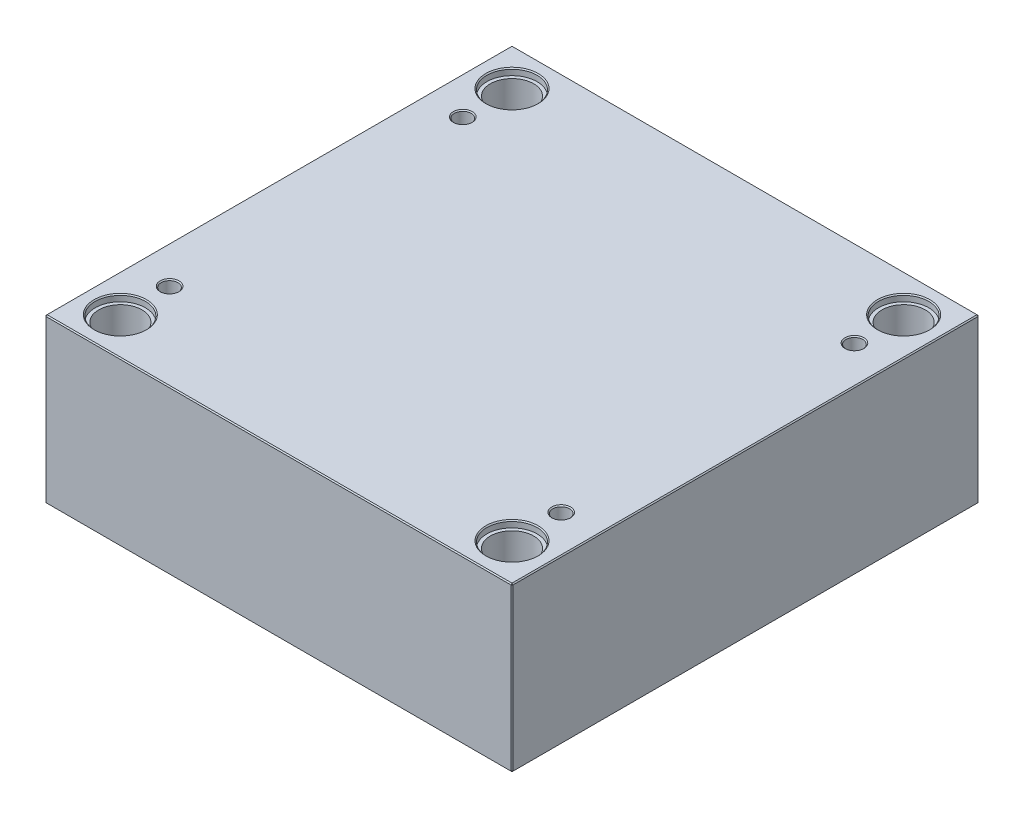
ISO-10303-21;
HEADER;
FILE_DESCRIPTION(('STEP AP214'),'2;1');
FILE_NAME('part.step','',(''),(''),'','','');
FILE_SCHEMA(('AUTOMOTIVE_DESIGN { 1 0 10303 214 1 1 1 1 }'));
ENDSEC;
DATA;
#1=APPLICATION_CONTEXT('core data for automotive mechanical design processes');
#2=APPLICATION_PROTOCOL_DEFINITION('international standard','automotive_design',2000,#1);
#3=PRODUCT_CONTEXT('',#1,'mechanical');
#4=PRODUCT('Part','Part','',(#3));
#5=PRODUCT_RELATED_PRODUCT_CATEGORY('part','',(#4));
#6=PRODUCT_DEFINITION_FORMATION('','',#4);
#7=PRODUCT_DEFINITION_CONTEXT('part definition',#1,'design');
#8=PRODUCT_DEFINITION('design','',#6,#7);
#9=PRODUCT_DEFINITION_SHAPE('','',#8);
#10=(LENGTH_UNIT() NAMED_UNIT(*) SI_UNIT(.MILLI.,.METRE.));
#11=(NAMED_UNIT(*) PLANE_ANGLE_UNIT() SI_UNIT($,.RADIAN.));
#12=(NAMED_UNIT(*) SI_UNIT($,.STERADIAN.) SOLID_ANGLE_UNIT());
#13=UNCERTAINTY_MEASURE_WITH_UNIT(LENGTH_MEASURE(1.E-05),#10,'distance_accuracy_value','');
#14=(GEOMETRIC_REPRESENTATION_CONTEXT(3) GLOBAL_UNCERTAINTY_ASSIGNED_CONTEXT((#13)) GLOBAL_UNIT_ASSIGNED_CONTEXT((#10,
#11,#12)) REPRESENTATION_CONTEXT('',''));
#15=CARTESIAN_POINT('',(0.,0.,0.));
#16=DIRECTION('',(0.,0.,1.));
#17=DIRECTION('',(1.,0.,0.));
#18=AXIS2_PLACEMENT_3D('',#15,#16,#17);
#19=CARTESIAN_POINT('',(-187.,0.,-187.));
#20=DIRECTION('',(0.,1.,0.));
#21=DIRECTION('',(0.,0.,1.));
#22=AXIS2_PLACEMENT_3D('',#19,#20,#21);
#23=CYLINDRICAL_SURFACE('',#22,20.65);
#24=CARTESIAN_POINT('',(-187.,0.999999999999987,-187.));
#25=DIRECTION('',(0.,1.,0.));
#26=DIRECTION('',(0.,0.,1.));
#27=AXIS2_PLACEMENT_3D('',#24,#25,#26);
#28=CIRCLE('',#27,20.65);
#29=CARTESIAN_POINT('',(-187.,0.999999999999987,-166.35));
#30=VERTEX_POINT('',#29);
#31=EDGE_CURVE('E472',#30,#30,#28,.F.);
#32=ORIENTED_EDGE('',*,*,#31,.T.);
#33=EDGE_LOOP('',(#32));
#34=FACE_BOUND('',#33,.T.);
#35=CARTESIAN_POINT('',(-187.,149.7,-187.));
#36=DIRECTION('',(0.,1.,0.));
#37=DIRECTION('',(0.,0.,1.));
#38=AXIS2_PLACEMENT_3D('',#35,#36,#37);
#39=CIRCLE('',#38,20.65);
#40=CARTESIAN_POINT('',(-187.,149.7,-166.35));
#41=VERTEX_POINT('',#40);
#42=EDGE_CURVE('E221',#41,#41,#39,.F.);
#43=ORIENTED_EDGE('',*,*,#42,.F.);
#44=EDGE_LOOP('',(#43));
#45=FACE_BOUND('',#44,.T.);
#46=ADVANCED_FACE('F16',(#34,#45),#23,.F.);
#47=CARTESIAN_POINT('',(187.,0.,-187.));
#48=DIRECTION('',(0.,1.,0.));
#49=DIRECTION('',(0.,0.,1.));
#50=AXIS2_PLACEMENT_3D('',#47,#48,#49);
#51=CYLINDRICAL_SURFACE('',#50,20.65);
#52=CARTESIAN_POINT('',(187.,0.999999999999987,-187.));
#53=DIRECTION('',(0.,1.,0.));
#54=DIRECTION('',(0.,0.,1.));
#55=AXIS2_PLACEMENT_3D('',#52,#53,#54);
#56=CIRCLE('',#55,20.65);
#57=CARTESIAN_POINT('',(187.,0.999999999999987,-166.35));
#58=VERTEX_POINT('',#57);
#59=EDGE_CURVE('E474',#58,#58,#56,.F.);
#60=ORIENTED_EDGE('',*,*,#59,.T.);
#61=EDGE_LOOP('',(#60));
#62=FACE_BOUND('',#61,.T.);
#63=CARTESIAN_POINT('',(187.,149.7,-187.));
#64=DIRECTION('',(0.,1.,0.));
#65=DIRECTION('',(0.,0.,1.));
#66=AXIS2_PLACEMENT_3D('',#63,#64,#65);
#67=CIRCLE('',#66,20.65);
#68=CARTESIAN_POINT('',(187.,149.7,-166.35));
#69=VERTEX_POINT('',#68);
#70=EDGE_CURVE('E218',#69,#69,#67,.F.);
#71=ORIENTED_EDGE('',*,*,#70,.F.);
#72=EDGE_LOOP('',(#71));
#73=FACE_BOUND('',#72,.T.);
#74=ADVANCED_FACE('F263',(#62,#73),#51,.F.);
#75=CARTESIAN_POINT('',(187.,0.,187.));
#76=DIRECTION('',(0.,1.,0.));
#77=DIRECTION('',(0.,0.,1.));
#78=AXIS2_PLACEMENT_3D('',#75,#76,#77);
#79=CYLINDRICAL_SURFACE('',#78,20.65);
#80=CARTESIAN_POINT('',(187.,0.999999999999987,187.));
#81=DIRECTION('',(0.,1.,0.));
#82=DIRECTION('',(0.,0.,1.));
#83=AXIS2_PLACEMENT_3D('',#80,#81,#82);
#84=CIRCLE('',#83,20.65);
#85=CARTESIAN_POINT('',(187.,0.999999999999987,207.65));
#86=VERTEX_POINT('',#85);
#87=EDGE_CURVE('E477',#86,#86,#84,.F.);
#88=ORIENTED_EDGE('',*,*,#87,.T.);
#89=EDGE_LOOP('',(#88));
#90=FACE_BOUND('',#89,.T.);
#91=CARTESIAN_POINT('',(187.,149.7,187.));
#92=DIRECTION('',(0.,1.,0.));
#93=DIRECTION('',(0.,0.,1.));
#94=AXIS2_PLACEMENT_3D('',#91,#92,#93);
#95=CIRCLE('',#94,20.65);
#96=CARTESIAN_POINT('',(187.,149.7,207.65));
#97=VERTEX_POINT('',#96);
#98=EDGE_CURVE('E214',#97,#97,#95,.F.);
#99=ORIENTED_EDGE('',*,*,#98,.F.);
#100=EDGE_LOOP('',(#99));
#101=FACE_BOUND('',#100,.T.);
#102=ADVANCED_FACE('F270',(#90,#101),#79,.F.);
#103=CARTESIAN_POINT('',(-187.,0.,187.));
#104=DIRECTION('',(0.,1.,0.));
#105=DIRECTION('',(0.,0.,1.));
#106=AXIS2_PLACEMENT_3D('',#103,#104,#105);
#107=CYLINDRICAL_SURFACE('',#106,20.65);
#108=CARTESIAN_POINT('',(-187.,0.999999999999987,187.));
#109=DIRECTION('',(0.,1.,0.));
#110=DIRECTION('',(0.,0.,1.));
#111=AXIS2_PLACEMENT_3D('',#108,#109,#110);
#112=CIRCLE('',#111,20.65);
#113=CARTESIAN_POINT('',(-187.,0.999999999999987,207.65));
#114=VERTEX_POINT('',#113);
#115=EDGE_CURVE('E480',#114,#114,#112,.F.);
#116=ORIENTED_EDGE('',*,*,#115,.T.);
#117=EDGE_LOOP('',(#116));
#118=FACE_BOUND('',#117,.T.);
#119=CARTESIAN_POINT('',(-187.,149.7,187.));
#120=DIRECTION('',(0.,1.,0.));
#121=DIRECTION('',(0.,0.,1.));
#122=AXIS2_PLACEMENT_3D('',#119,#120,#121);
#123=CIRCLE('',#122,20.65);
#124=CARTESIAN_POINT('',(-187.,149.7,207.65));
#125=VERTEX_POINT('',#124);
#126=EDGE_CURVE('E211',#125,#125,#123,.F.);
#127=ORIENTED_EDGE('',*,*,#126,.F.);
#128=EDGE_LOOP('',(#127));
#129=FACE_BOUND('',#128,.T.);
#130=ADVANCED_FACE('F277',(#118,#129),#107,.F.);
#131=CARTESIAN_POINT('',(-223.,156.,223.));
#132=DIRECTION('',(1.,0.,0.));
#133=DIRECTION('',(0.,0.,-1.));
#134=AXIS2_PLACEMENT_3D('',#131,#132,#133);
#135=PLANE('',#134);
#136=DIRECTION('',(0.,-1.,0.));
#137=VECTOR('',#136,1.);
#138=CARTESIAN_POINT('',(-223.,156.,-222.));
#139=LINE('',#138,#137);
#140=CARTESIAN_POINT('',(-223.,155.,-222.));
#141=VERTEX_POINT('',#140);
#142=CARTESIAN_POINT('',(-223.,1.00000000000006,-222.));
#143=VERTEX_POINT('',#142);
#144=EDGE_CURVE('E487',#141,#143,#139,.T.);
#145=ORIENTED_EDGE('',*,*,#144,.T.);
#146=DIRECTION('',(0.,0.,1.));
#147=VECTOR('',#146,1.);
#148=CARTESIAN_POINT('',(-223.,1.00000000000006,223.));
#149=LINE('',#148,#147);
#150=CARTESIAN_POINT('',(-223.,1.00000000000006,222.));
#151=VERTEX_POINT('',#150);
#152=EDGE_CURVE('E490',#143,#151,#149,.T.);
#153=ORIENTED_EDGE('',*,*,#152,.T.);
#154=DIRECTION('',(0.,1.,0.));
#155=VECTOR('',#154,1.);
#156=CARTESIAN_POINT('',(-223.,156.,222.));
#157=LINE('',#156,#155);
#158=CARTESIAN_POINT('',(-223.,155.,222.));
#159=VERTEX_POINT('',#158);
#160=EDGE_CURVE('E485',#151,#159,#157,.T.);
#161=ORIENTED_EDGE('',*,*,#160,.T.);
#162=DIRECTION('',(0.,0.,-1.));
#163=VECTOR('',#162,1.);
#164=CARTESIAN_POINT('',(-223.,155.,-223.));
#165=LINE('',#164,#163);
#166=EDGE_CURVE('E483',#159,#141,#165,.T.);
#167=ORIENTED_EDGE('',*,*,#166,.T.);
#168=EDGE_LOOP('',(#145,#153,#161,#167));
#169=FACE_BOUND('',#168,.T.);
#170=ADVANCED_FACE('F298',(#169),#135,.F.);
#171=CARTESIAN_POINT('',(223.,156.,223.));
#172=DIRECTION('',(0.,0.,-1.));
#173=DIRECTION('',(-1.,0.,0.));
#174=AXIS2_PLACEMENT_3D('',#171,#172,#173);
#175=PLANE('',#174);
#176=DIRECTION('',(-1.,0.,0.));
#177=VECTOR('',#176,1.);
#178=CARTESIAN_POINT('',(-223.,155.,223.));
#179=LINE('',#178,#177);
#180=CARTESIAN_POINT('',(222.,155.,223.));
#181=VERTEX_POINT('',#180);
#182=CARTESIAN_POINT('',(-222.,155.,223.));
#183=VERTEX_POINT('',#182);
#184=EDGE_CURVE('E509',#181,#183,#179,.T.);
#185=ORIENTED_EDGE('',*,*,#184,.T.);
#186=DIRECTION('',(0.,-1.,0.));
#187=VECTOR('',#186,1.);
#188=CARTESIAN_POINT('',(-222.,156.,223.));
#189=LINE('',#188,#187);
#190=CARTESIAN_POINT('',(-222.,1.,223.));
#191=VERTEX_POINT('',#190);
#192=EDGE_CURVE('E515',#183,#191,#189,.T.);
#193=ORIENTED_EDGE('',*,*,#192,.T.);
#194=DIRECTION('',(1.,0.,0.));
#195=VECTOR('',#194,1.);
#196=CARTESIAN_POINT('',(223.,1.,223.));
#197=LINE('',#196,#195);
#198=CARTESIAN_POINT('',(222.,1.,223.));
#199=VERTEX_POINT('',#198);
#200=EDGE_CURVE('E513',#191,#199,#197,.T.);
#201=ORIENTED_EDGE('',*,*,#200,.T.);
#202=DIRECTION('',(0.,1.,0.));
#203=VECTOR('',#202,1.);
#204=CARTESIAN_POINT('',(222.,156.,223.));
#205=LINE('',#204,#203);
#206=EDGE_CURVE('E511',#199,#181,#205,.T.);
#207=ORIENTED_EDGE('',*,*,#206,.T.);
#208=EDGE_LOOP('',(#185,#193,#201,#207));
#209=FACE_BOUND('',#208,.T.);
#210=ADVANCED_FACE('F294',(#209),#175,.F.);
#211=CARTESIAN_POINT('',(223.,156.,223.));
#212=DIRECTION('',(-1.,0.,0.));
#213=DIRECTION('',(0.,0.,1.));
#214=AXIS2_PLACEMENT_3D('',#211,#212,#213);
#215=PLANE('',#214);
#216=DIRECTION('',(0.,0.,-1.));
#217=VECTOR('',#216,1.);
#218=CARTESIAN_POINT('',(223.,1.,223.));
#219=LINE('',#218,#217);
#220=CARTESIAN_POINT('',(223.,1.,222.));
#221=VERTEX_POINT('',#220);
#222=CARTESIAN_POINT('',(223.,1.,-222.));
#223=VERTEX_POINT('',#222);
#224=EDGE_CURVE('E504',#221,#223,#219,.T.);
#225=ORIENTED_EDGE('',*,*,#224,.T.);
#226=DIRECTION('',(0.,1.,0.));
#227=VECTOR('',#226,1.);
#228=CARTESIAN_POINT('',(223.,156.,-222.));
#229=LINE('',#228,#227);
#230=CARTESIAN_POINT('',(223.,155.,-222.));
#231=VERTEX_POINT('',#230);
#232=EDGE_CURVE('E506',#223,#231,#229,.T.);
#233=ORIENTED_EDGE('',*,*,#232,.T.);
#234=DIRECTION('',(0.,0.,1.));
#235=VECTOR('',#234,1.);
#236=CARTESIAN_POINT('',(223.,155.,223.));
#237=LINE('',#236,#235);
#238=CARTESIAN_POINT('',(223.,155.,222.));
#239=VERTEX_POINT('',#238);
#240=EDGE_CURVE('E500',#231,#239,#237,.T.);
#241=ORIENTED_EDGE('',*,*,#240,.T.);
#242=DIRECTION('',(0.,-1.,0.));
#243=VECTOR('',#242,1.);
#244=CARTESIAN_POINT('',(223.,156.,222.));
#245=LINE('',#244,#243);
#246=EDGE_CURVE('E502',#239,#221,#245,.T.);
#247=ORIENTED_EDGE('',*,*,#246,.T.);
#248=EDGE_LOOP('',(#225,#233,#241,#247));
#249=FACE_BOUND('',#248,.T.);
#250=ADVANCED_FACE('F290',(#249),#215,.F.);
#251=CARTESIAN_POINT('',(223.,156.,-223.));
#252=DIRECTION('',(0.,0.,1.));
#253=DIRECTION('',(1.,0.,0.));
#254=AXIS2_PLACEMENT_3D('',#251,#252,#253);
#255=PLANE('',#254);
#256=DIRECTION('',(0.,-1.,0.));
#257=VECTOR('',#256,1.);
#258=CARTESIAN_POINT('',(222.,156.,-223.));
#259=LINE('',#258,#257);
#260=CARTESIAN_POINT('',(222.,155.,-223.));
#261=VERTEX_POINT('',#260);
#262=CARTESIAN_POINT('',(222.,1.,-223.));
#263=VERTEX_POINT('',#262);
#264=EDGE_CURVE('E494',#261,#263,#259,.T.);
#265=ORIENTED_EDGE('',*,*,#264,.T.);
#266=DIRECTION('',(-1.,0.,0.));
#267=VECTOR('',#266,1.);
#268=CARTESIAN_POINT('',(223.,1.,-223.));
#269=LINE('',#268,#267);
#270=CARTESIAN_POINT('',(-222.,1.,-223.));
#271=VERTEX_POINT('',#270);
#272=EDGE_CURVE('E138',#263,#271,#269,.T.);
#273=ORIENTED_EDGE('',*,*,#272,.T.);
#274=DIRECTION('',(0.,1.,0.));
#275=VECTOR('',#274,1.);
#276=CARTESIAN_POINT('',(-222.,156.,-223.));
#277=LINE('',#276,#275);
#278=CARTESIAN_POINT('',(-222.,155.,-223.));
#279=VERTEX_POINT('',#278);
#280=EDGE_CURVE('E496',#271,#279,#277,.T.);
#281=ORIENTED_EDGE('',*,*,#280,.T.);
#282=DIRECTION('',(1.,0.,0.));
#283=VECTOR('',#282,1.);
#284=CARTESIAN_POINT('',(223.,155.,-223.));
#285=LINE('',#284,#283);
#286=EDGE_CURVE('E492',#279,#261,#285,.T.);
#287=ORIENTED_EDGE('',*,*,#286,.T.);
#288=EDGE_LOOP('',(#265,#273,#281,#287));
#289=FACE_BOUND('',#288,.T.);
#290=ADVANCED_FACE('F282',(#289),#255,.F.);
#291=CARTESIAN_POINT('',(0.,156.,0.));
#292=DIRECTION('',(0.,1.,0.));
#293=DIRECTION('',(0.,0.,1.));
#294=AXIS2_PLACEMENT_3D('',#291,#292,#293);
#295=PLANE('',#294);
#296=CARTESIAN_POINT('',(187.,156.,187.));
#297=DIRECTION('',(0.,1.,0.));
#298=DIRECTION('',(0.,0.,1.));
#299=AXIS2_PLACEMENT_3D('',#296,#297,#298);
#300=CIRCLE('',#299,25.);
#301=CARTESIAN_POINT('',(187.,156.,212.));
#302=VERTEX_POINT('',#301);
#303=EDGE_CURVE('E236',#302,#302,#300,.F.);
#304=ORIENTED_EDGE('',*,*,#303,.T.);
#305=EDGE_LOOP('',(#304));
#306=FACE_BOUND('',#305,.T.);
#307=CARTESIAN_POINT('',(-187.,156.,187.));
#308=DIRECTION('',(0.,1.,0.));
#309=DIRECTION('',(0.,0.,1.));
#310=AXIS2_PLACEMENT_3D('',#307,#308,#309);
#311=CIRCLE('',#310,25.);
#312=CARTESIAN_POINT('',(-187.,156.,212.));
#313=VERTEX_POINT('',#312);
#314=EDGE_CURVE('E233',#313,#313,#311,.F.);
#315=ORIENTED_EDGE('',*,*,#314,.T.);
#316=EDGE_LOOP('',(#315));
#317=FACE_BOUND('',#316,.T.);
#318=CARTESIAN_POINT('',(187.,156.,-187.));
#319=DIRECTION('',(0.,1.,0.));
#320=DIRECTION('',(0.,0.,1.));
#321=AXIS2_PLACEMENT_3D('',#318,#319,#320);
#322=CIRCLE('',#321,25.);
#323=CARTESIAN_POINT('',(187.,156.,-162.));
#324=VERTEX_POINT('',#323);
#325=EDGE_CURVE('E230',#324,#324,#322,.F.);
#326=ORIENTED_EDGE('',*,*,#325,.T.);
#327=EDGE_LOOP('',(#326));
#328=FACE_BOUND('',#327,.T.);
#329=CARTESIAN_POINT('',(-187.,156.,-187.));
#330=DIRECTION('',(0.,1.,0.));
#331=DIRECTION('',(0.,0.,1.));
#332=AXIS2_PLACEMENT_3D('',#329,#330,#331);
#333=CIRCLE('',#332,25.);
#334=CARTESIAN_POINT('',(-187.,156.,-162.));
#335=VERTEX_POINT('',#334);
#336=EDGE_CURVE('E227',#335,#335,#333,.F.);
#337=ORIENTED_EDGE('',*,*,#336,.T.);
#338=EDGE_LOOP('',(#337));
#339=FACE_BOUND('',#338,.T.);
#340=CARTESIAN_POINT('',(-187.,156.,140.));
#341=DIRECTION('',(0.,1.,0.));
#342=DIRECTION('',(0.,0.,1.));
#343=AXIS2_PLACEMENT_3D('',#340,#341,#342);
#344=CIRCLE('',#343,9.);
#345=CARTESIAN_POINT('',(-187.,156.,149.));
#346=VERTEX_POINT('',#345);
#347=EDGE_CURVE('E198',#346,#346,#344,.F.);
#348=ORIENTED_EDGE('',*,*,#347,.T.);
#349=EDGE_LOOP('',(#348));
#350=FACE_BOUND('',#349,.T.);
#351=CARTESIAN_POINT('',(187.,156.,140.));
#352=DIRECTION('',(0.,1.,0.));
#353=DIRECTION('',(0.,0.,1.));
#354=AXIS2_PLACEMENT_3D('',#351,#352,#353);
#355=CIRCLE('',#354,9.);
#356=CARTESIAN_POINT('',(187.,156.,149.));
#357=VERTEX_POINT('',#356);
#358=EDGE_CURVE('E195',#357,#357,#355,.F.);
#359=ORIENTED_EDGE('',*,*,#358,.T.);
#360=EDGE_LOOP('',(#359));
#361=FACE_BOUND('',#360,.T.);
#362=CARTESIAN_POINT('',(187.,156.,-140.));
#363=DIRECTION('',(0.,1.,0.));
#364=DIRECTION('',(0.,0.,1.));
#365=AXIS2_PLACEMENT_3D('',#362,#363,#364);
#366=CIRCLE('',#365,9.);
#367=CARTESIAN_POINT('',(187.,156.,-131.));
#368=VERTEX_POINT('',#367);
#369=EDGE_CURVE('E192',#368,#368,#366,.F.);
#370=ORIENTED_EDGE('',*,*,#369,.T.);
#371=EDGE_LOOP('',(#370));
#372=FACE_BOUND('',#371,.T.);
#373=CARTESIAN_POINT('',(-187.,156.,-140.));
#374=DIRECTION('',(0.,1.,0.));
#375=DIRECTION('',(0.,0.,1.));
#376=AXIS2_PLACEMENT_3D('',#373,#374,#375);
#377=CIRCLE('',#376,9.);
#378=CARTESIAN_POINT('',(-187.,156.,-131.));
#379=VERTEX_POINT('',#378);
#380=EDGE_CURVE('E188',#379,#379,#377,.F.);
#381=ORIENTED_EDGE('',*,*,#380,.T.);
#382=EDGE_LOOP('',(#381));
#383=FACE_BOUND('',#382,.T.);
#384=DIRECTION('',(0.,0.,-1.));
#385=VECTOR('',#384,1.);
#386=CARTESIAN_POINT('',(222.,156.,-223.));
#387=LINE('',#386,#385);
#388=CARTESIAN_POINT('',(222.,156.,222.));
#389=VERTEX_POINT('',#388);
#390=CARTESIAN_POINT('',(222.,156.,-222.));
#391=VERTEX_POINT('',#390);
#392=EDGE_CURVE('E31',#389,#391,#387,.T.);
#393=ORIENTED_EDGE('',*,*,#392,.T.);
#394=DIRECTION('',(-1.,0.,0.));
#395=VECTOR('',#394,1.);
#396=CARTESIAN_POINT('',(-223.,156.,-222.));
#397=LINE('',#396,#395);
#398=CARTESIAN_POINT('',(-222.,156.,-222.));
#399=VERTEX_POINT('',#398);
#400=EDGE_CURVE('E189',#391,#399,#397,.T.);
#401=ORIENTED_EDGE('',*,*,#400,.T.);
#402=DIRECTION('',(0.,0.,1.));
#403=VECTOR('',#402,1.);
#404=CARTESIAN_POINT('',(-222.,156.,223.));
#405=LINE('',#404,#403);
#406=CARTESIAN_POINT('',(-222.,156.,222.));
#407=VERTEX_POINT('',#406);
#408=EDGE_CURVE('E518',#399,#407,#405,.T.);
#409=ORIENTED_EDGE('',*,*,#408,.T.);
#410=DIRECTION('',(1.,0.,0.));
#411=VECTOR('',#410,1.);
#412=CARTESIAN_POINT('',(223.,156.,222.));
#413=LINE('',#412,#411);
#414=EDGE_CURVE('E36',#407,#389,#413,.T.);
#415=ORIENTED_EDGE('',*,*,#414,.T.);
#416=EDGE_LOOP('',(#393,#401,#409,#415));
#417=FACE_BOUND('',#416,.T.);
#418=ADVANCED_FACE('F279',(#306,#317,#328,#339,#350,#361,#372,#383,#417),#295,.T.);
#419=CARTESIAN_POINT('',(0.,0.,0.));
#420=DIRECTION('',(0.,1.,0.));
#421=DIRECTION('',(0.,0.,1.));
#422=AXIS2_PLACEMENT_3D('',#419,#420,#421);
#423=PLANE('',#422);
#424=CARTESIAN_POINT('',(-187.,0.,-187.));
#425=DIRECTION('',(0.,1.,0.));
#426=DIRECTION('',(0.,0.,1.));
#427=AXIS2_PLACEMENT_3D('',#424,#425,#426);
#428=CIRCLE('',#427,21.65);
#429=CARTESIAN_POINT('',(-187.,0.,-165.35));
#430=VERTEX_POINT('',#429);
#431=EDGE_CURVE('E469',#430,#430,#428,.T.);
#432=ORIENTED_EDGE('',*,*,#431,.T.);
#433=EDGE_LOOP('',(#432));
#434=FACE_BOUND('',#433,.T.);
#435=CARTESIAN_POINT('',(187.,0.,-187.));
#436=DIRECTION('',(0.,1.,0.));
#437=DIRECTION('',(0.,0.,1.));
#438=AXIS2_PLACEMENT_3D('',#435,#436,#437);
#439=CIRCLE('',#438,21.65);
#440=CARTESIAN_POINT('',(187.,0.,-165.35));
#441=VERTEX_POINT('',#440);
#442=EDGE_CURVE('E466',#441,#441,#439,.T.);
#443=ORIENTED_EDGE('',*,*,#442,.T.);
#444=EDGE_LOOP('',(#443));
#445=FACE_BOUND('',#444,.T.);
#446=CARTESIAN_POINT('',(187.,0.,187.));
#447=DIRECTION('',(0.,1.,0.));
#448=DIRECTION('',(0.,0.,1.));
#449=AXIS2_PLACEMENT_3D('',#446,#447,#448);
#450=CIRCLE('',#449,21.65);
#451=CARTESIAN_POINT('',(187.,0.,208.65));
#452=VERTEX_POINT('',#451);
#453=EDGE_CURVE('E463',#452,#452,#450,.T.);
#454=ORIENTED_EDGE('',*,*,#453,.T.);
#455=EDGE_LOOP('',(#454));
#456=FACE_BOUND('',#455,.T.);
#457=CARTESIAN_POINT('',(-187.,0.,187.));
#458=DIRECTION('',(0.,1.,0.));
#459=DIRECTION('',(0.,0.,1.));
#460=AXIS2_PLACEMENT_3D('',#457,#458,#459);
#461=CIRCLE('',#460,21.65);
#462=CARTESIAN_POINT('',(-187.,0.,208.65));
#463=VERTEX_POINT('',#462);
#464=EDGE_CURVE('E460',#463,#463,#461,.T.);
#465=ORIENTED_EDGE('',*,*,#464,.T.);
#466=EDGE_LOOP('',(#465));
#467=FACE_BOUND('',#466,.T.);
#468=DIRECTION('',(0.,0.,1.));
#469=VECTOR('',#468,1.);
#470=CARTESIAN_POINT('',(222.,0.,0.));
#471=LINE('',#470,#469);
#472=CARTESIAN_POINT('',(222.,0.,-222.));
#473=VERTEX_POINT('',#472);
#474=CARTESIAN_POINT('',(222.,0.,222.));
#475=VERTEX_POINT('',#474);
#476=EDGE_CURVE('E108',#473,#475,#471,.T.);
#477=ORIENTED_EDGE('',*,*,#476,.T.);
#478=DIRECTION('',(-1.,0.,0.));
#479=VECTOR('',#478,1.);
#480=CARTESIAN_POINT('',(0.,0.,222.));
#481=LINE('',#480,#479);
#482=CARTESIAN_POINT('',(-222.,0.,222.));
#483=VERTEX_POINT('',#482);
#484=EDGE_CURVE('E458',#475,#483,#481,.T.);
#485=ORIENTED_EDGE('',*,*,#484,.T.);
#486=DIRECTION('',(0.,0.,-1.));
#487=VECTOR('',#486,1.);
#488=CARTESIAN_POINT('',(-222.,0.,0.));
#489=LINE('',#488,#487);
#490=CARTESIAN_POINT('',(-222.,0.,-222.));
#491=VERTEX_POINT('',#490);
#492=EDGE_CURVE('E110',#483,#491,#489,.T.);
#493=ORIENTED_EDGE('',*,*,#492,.T.);
#494=DIRECTION('',(1.,0.,0.));
#495=VECTOR('',#494,1.);
#496=CARTESIAN_POINT('',(0.,0.,-222.));
#497=LINE('',#496,#495);
#498=EDGE_CURVE('E104',#491,#473,#497,.T.);
#499=ORIENTED_EDGE('',*,*,#498,.T.);
#500=EDGE_LOOP('',(#477,#485,#493,#499));
#501=FACE_BOUND('',#500,.T.);
#502=ADVANCED_FACE('F106',(#434,#445,#456,#467,#501),#423,.F.);
#503=CARTESIAN_POINT('',(-187.,0.,-187.));
#504=DIRECTION('',(0.,-1.,0.));
#505=DIRECTION('',(0.,0.,-1.));
#506=AXIS2_PLACEMENT_3D('',#503,#504,#505);
#507=CONICAL_SURFACE('',#506,21.65,0.785398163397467);
#508=ORIENTED_EDGE('',*,*,#31,.F.);
#509=EDGE_LOOP('',(#508));
#510=FACE_BOUND('',#509,.T.);
#511=ORIENTED_EDGE('',*,*,#431,.F.);
#512=EDGE_LOOP('',(#511));
#513=FACE_BOUND('',#512,.T.);
#514=ADVANCED_FACE('F286',(#510,#513),#507,.F.);
#515=CARTESIAN_POINT('',(187.,0.,-187.));
#516=DIRECTION('',(0.,-1.,0.));
#517=DIRECTION('',(0.,0.,-1.));
#518=AXIS2_PLACEMENT_3D('',#515,#516,#517);
#519=CONICAL_SURFACE('',#518,21.65,0.785398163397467);
#520=ORIENTED_EDGE('',*,*,#59,.F.);
#521=EDGE_LOOP('',(#520));
#522=FACE_BOUND('',#521,.T.);
#523=ORIENTED_EDGE('',*,*,#442,.F.);
#524=EDGE_LOOP('',(#523));
#525=FACE_BOUND('',#524,.T.);
#526=ADVANCED_FACE('F305',(#522,#525),#519,.F.);
#527=CARTESIAN_POINT('',(187.,0.,187.));
#528=DIRECTION('',(0.,-1.,0.));
#529=DIRECTION('',(0.,0.,-1.));
#530=AXIS2_PLACEMENT_3D('',#527,#528,#529);
#531=CONICAL_SURFACE('',#530,21.65,0.785398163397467);
#532=ORIENTED_EDGE('',*,*,#87,.F.);
#533=EDGE_LOOP('',(#532));
#534=FACE_BOUND('',#533,.T.);
#535=ORIENTED_EDGE('',*,*,#453,.F.);
#536=EDGE_LOOP('',(#535));
#537=FACE_BOUND('',#536,.T.);
#538=ADVANCED_FACE('F309',(#534,#537),#531,.F.);
#539=CARTESIAN_POINT('',(-187.,0.,187.));
#540=DIRECTION('',(0.,-1.,0.));
#541=DIRECTION('',(0.,0.,-1.));
#542=AXIS2_PLACEMENT_3D('',#539,#540,#541);
#543=CONICAL_SURFACE('',#542,21.65,0.785398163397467);
#544=ORIENTED_EDGE('',*,*,#115,.F.);
#545=EDGE_LOOP('',(#544));
#546=FACE_BOUND('',#545,.T.);
#547=ORIENTED_EDGE('',*,*,#464,.F.);
#548=EDGE_LOOP('',(#547));
#549=FACE_BOUND('',#548,.T.);
#550=ADVANCED_FACE('F313',(#546,#549),#543,.F.);
#551=CARTESIAN_POINT('',(223.,156.,222.));
#552=DIRECTION('',(-0.707106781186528,0.,-0.707106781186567));
#553=DIRECTION('',(0.,-1.,0.));
#554=AXIS2_PLACEMENT_3D('',#551,#552,#553);
#555=PLANE('',#554);
#556=DIRECTION('',(-0.707106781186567,0.,0.707106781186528));
#557=VECTOR('',#556,1.);
#558=CARTESIAN_POINT('',(222.,155.,223.));
#559=LINE('',#558,#557);
#560=EDGE_CURVE('E126',#181,#239,#559,.F.);
#561=ORIENTED_EDGE('',*,*,#560,.F.);
#562=ORIENTED_EDGE('',*,*,#206,.F.);
#563=DIRECTION('',(0.707106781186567,0.,-0.707106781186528));
#564=VECTOR('',#563,1.);
#565=CARTESIAN_POINT('',(222.,1.,223.));
#566=LINE('',#565,#564);
#567=EDGE_CURVE('E180',#221,#199,#566,.F.);
#568=ORIENTED_EDGE('',*,*,#567,.F.);
#569=ORIENTED_EDGE('',*,*,#246,.F.);
#570=EDGE_LOOP('',(#561,#562,#568,#569));
#571=FACE_BOUND('',#570,.T.);
#572=ADVANCED_FACE('F317',(#571),#555,.F.);
#573=CARTESIAN_POINT('',(222.,155.,223.));
#574=DIRECTION('',(0.577350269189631,0.577350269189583,0.577350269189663));
#575=DIRECTION('',(0.707106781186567,0.,-0.707106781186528));
#576=AXIS2_PLACEMENT_3D('',#573,#574,#575);
#577=PLANE('',#576);
#578=DIRECTION('',(0.,-0.707106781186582,0.707106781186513));
#579=VECTOR('',#578,1.);
#580=CARTESIAN_POINT('',(222.,155.,223.));
#581=LINE('',#580,#579);
#582=EDGE_CURVE('E175',#181,#389,#581,.F.);
#583=ORIENTED_EDGE('',*,*,#582,.F.);
#584=ORIENTED_EDGE('',*,*,#560,.T.);
#585=DIRECTION('',(-0.707106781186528,0.707106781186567,0.));
#586=VECTOR('',#585,1.);
#587=CARTESIAN_POINT('',(222.5,155.5,222.));
#588=LINE('',#587,#586);
#589=EDGE_CURVE('E177',#389,#239,#588,.F.);
#590=ORIENTED_EDGE('',*,*,#589,.F.);
#591=EDGE_LOOP('',(#583,#584,#590));
#592=FACE_BOUND('',#591,.T.);
#593=ADVANCED_FACE('F385',(#592),#577,.T.);
#594=CARTESIAN_POINT('',(222.,1.,223.));
#595=DIRECTION('',(0.577350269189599,-0.577350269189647,0.577350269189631));
#596=DIRECTION('',(0.,-0.707106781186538,-0.707106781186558));
#597=AXIS2_PLACEMENT_3D('',#594,#595,#596);
#598=PLANE('',#597);
#599=DIRECTION('',(-0.707106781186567,-0.707106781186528,0.));
#600=VECTOR('',#599,1.);
#601=CARTESIAN_POINT('',(222.5,0.499999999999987,222.));
#602=LINE('',#601,#600);
#603=EDGE_CURVE('E124',#221,#475,#602,.T.);
#604=ORIENTED_EDGE('',*,*,#603,.F.);
#605=ORIENTED_EDGE('',*,*,#567,.T.);
#606=DIRECTION('',(0.,0.707106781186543,0.707106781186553));
#607=VECTOR('',#606,1.);
#608=CARTESIAN_POINT('',(222.,1.,223.));
#609=LINE('',#608,#607);
#610=EDGE_CURVE('E172',#475,#199,#609,.T.);
#611=ORIENTED_EDGE('',*,*,#610,.F.);
#612=EDGE_LOOP('',(#604,#605,#611));
#613=FACE_BOUND('',#612,.T.);
#614=ADVANCED_FACE('F381',(#613),#598,.T.);
#615=CARTESIAN_POINT('',(222.,156.,0.));
#616=DIRECTION('',(0.707106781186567,0.707106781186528,0.));
#617=DIRECTION('',(0.,0.,1.));
#618=AXIS2_PLACEMENT_3D('',#615,#616,#617);
#619=PLANE('',#618);
#620=ORIENTED_EDGE('',*,*,#589,.T.);
#621=ORIENTED_EDGE('',*,*,#240,.F.);
#622=DIRECTION('',(0.707106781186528,-0.707106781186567,0.));
#623=VECTOR('',#622,1.);
#624=CARTESIAN_POINT('',(223.,155.,-222.));
#625=LINE('',#624,#623);
#626=EDGE_CURVE('E166',#391,#231,#625,.T.);
#627=ORIENTED_EDGE('',*,*,#626,.F.);
#628=ORIENTED_EDGE('',*,*,#392,.F.);
#629=EDGE_LOOP('',(#620,#621,#627,#628));
#630=FACE_BOUND('',#629,.T.);
#631=ADVANCED_FACE('F377',(#630),#619,.T.);
#632=CARTESIAN_POINT('',(0.,156.,222.));
#633=DIRECTION('',(0.,0.707106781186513,0.707106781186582));
#634=DIRECTION('',(-1.,0.,0.));
#635=AXIS2_PLACEMENT_3D('',#632,#633,#634);
#636=PLANE('',#635);
#637=ORIENTED_EDGE('',*,*,#582,.T.);
#638=ORIENTED_EDGE('',*,*,#414,.F.);
#639=DIRECTION('',(0.,0.707106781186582,-0.707106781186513));
#640=VECTOR('',#639,1.);
#641=CARTESIAN_POINT('',(-222.,155.5,222.5));
#642=LINE('',#641,#640);
#643=EDGE_CURVE('E163',#183,#407,#642,.T.);
#644=ORIENTED_EDGE('',*,*,#643,.F.);
#645=ORIENTED_EDGE('',*,*,#184,.F.);
#646=EDGE_LOOP('',(#637,#638,#644,#645));
#647=FACE_BOUND('',#646,.T.);
#648=ADVANCED_FACE('F373',(#647),#636,.T.);
#649=CARTESIAN_POINT('',(-222.,156.,223.));
#650=DIRECTION('',(0.707106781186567,0.,-0.707106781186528));
#651=DIRECTION('',(0.,-1.,0.));
#652=AXIS2_PLACEMENT_3D('',#649,#650,#651);
#653=PLANE('',#652);
#654=DIRECTION('',(0.707106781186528,0.,0.707106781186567));
#655=VECTOR('',#654,1.);
#656=CARTESIAN_POINT('',(-222.,1.,223.));
#657=LINE('',#656,#655);
#658=EDGE_CURVE('E157',#191,#151,#657,.F.);
#659=ORIENTED_EDGE('',*,*,#658,.F.);
#660=ORIENTED_EDGE('',*,*,#192,.F.);
#661=DIRECTION('',(-0.707106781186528,0.,-0.707106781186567));
#662=VECTOR('',#661,1.);
#663=CARTESIAN_POINT('',(-223.,155.,222.));
#664=LINE('',#663,#662);
#665=EDGE_CURVE('E160',#159,#183,#664,.F.);
#666=ORIENTED_EDGE('',*,*,#665,.F.);
#667=ORIENTED_EDGE('',*,*,#160,.F.);
#668=EDGE_LOOP('',(#659,#660,#666,#667));
#669=FACE_BOUND('',#668,.T.);
#670=ADVANCED_FACE('F369',(#669),#653,.F.);
#671=CARTESIAN_POINT('',(223.,1.,223.));
#672=DIRECTION('',(0.,0.707106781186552,-0.707106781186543));
#673=DIRECTION('',(1.,0.,0.));
#674=AXIS2_PLACEMENT_3D('',#671,#672,#673);
#675=PLANE('',#674);
#676=ORIENTED_EDGE('',*,*,#610,.T.);
#677=ORIENTED_EDGE('',*,*,#200,.F.);
#678=DIRECTION('',(0.,-0.707106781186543,-0.707106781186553));
#679=VECTOR('',#678,1.);
#680=CARTESIAN_POINT('',(-222.,1.,223.));
#681=LINE('',#680,#679);
#682=EDGE_CURVE('E135',#483,#191,#681,.F.);
#683=ORIENTED_EDGE('',*,*,#682,.F.);
#684=ORIENTED_EDGE('',*,*,#484,.F.);
#685=EDGE_LOOP('',(#676,#677,#683,#684));
#686=FACE_BOUND('',#685,.T.);
#687=ADVANCED_FACE('F366',(#686),#675,.F.);
#688=CARTESIAN_POINT('',(223.,1.,223.));
#689=DIRECTION('',(-0.707106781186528,0.707106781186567,0.));
#690=DIRECTION('',(0.,0.,-1.));
#691=AXIS2_PLACEMENT_3D('',#688,#689,#690);
#692=PLANE('',#691);
#693=ORIENTED_EDGE('',*,*,#603,.T.);
#694=ORIENTED_EDGE('',*,*,#476,.F.);
#695=DIRECTION('',(0.707106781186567,0.707106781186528,0.));
#696=VECTOR('',#695,1.);
#697=CARTESIAN_POINT('',(222.5,0.500000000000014,-222.));
#698=LINE('',#697,#696);
#699=EDGE_CURVE('E121',#223,#473,#698,.F.);
#700=ORIENTED_EDGE('',*,*,#699,.F.);
#701=ORIENTED_EDGE('',*,*,#224,.F.);
#702=EDGE_LOOP('',(#693,#694,#700,#701));
#703=FACE_BOUND('',#702,.T.);
#704=ADVANCED_FACE('F119',(#703),#692,.F.);
#705=CARTESIAN_POINT('',(222.,156.,-223.));
#706=DIRECTION('',(-0.707106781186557,0.,0.707106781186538));
#707=DIRECTION('',(0.,-1.,0.));
#708=AXIS2_PLACEMENT_3D('',#705,#706,#707);
#709=PLANE('',#708);
#710=DIRECTION('',(0.707106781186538,0.,0.707106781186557));
#711=VECTOR('',#710,1.);
#712=CARTESIAN_POINT('',(223.,155.,-222.));
#713=LINE('',#712,#711);
#714=EDGE_CURVE('E168',#231,#261,#713,.F.);
#715=ORIENTED_EDGE('',*,*,#714,.F.);
#716=ORIENTED_EDGE('',*,*,#232,.F.);
#717=DIRECTION('',(-0.707106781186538,0.,-0.707106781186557));
#718=VECTOR('',#717,1.);
#719=CARTESIAN_POINT('',(222.,1.,-223.));
#720=LINE('',#719,#718);
#721=EDGE_CURVE('E134',#263,#223,#720,.F.);
#722=ORIENTED_EDGE('',*,*,#721,.F.);
#723=ORIENTED_EDGE('',*,*,#264,.F.);
#724=EDGE_LOOP('',(#715,#716,#722,#723));
#725=FACE_BOUND('',#724,.T.);
#726=ADVANCED_FACE('F359',(#725),#709,.F.);
#727=CARTESIAN_POINT('',(223.,155.,-222.));
#728=DIRECTION('',(0.577350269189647,0.577350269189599,-0.577350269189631));
#729=DIRECTION('',(-0.707106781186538,0.,-0.707106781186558));
#730=AXIS2_PLACEMENT_3D('',#727,#728,#729);
#731=PLANE('',#730);
#732=ORIENTED_EDGE('',*,*,#626,.T.);
#733=ORIENTED_EDGE('',*,*,#714,.T.);
#734=DIRECTION('',(0.,0.707106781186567,0.707106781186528));
#735=VECTOR('',#734,1.);
#736=CARTESIAN_POINT('',(222.,155.5,-222.5));
#737=LINE('',#736,#735);
#738=EDGE_CURVE('E152',#391,#261,#737,.F.);
#739=ORIENTED_EDGE('',*,*,#738,.F.);
#740=EDGE_LOOP('',(#732,#733,#739));
#741=FACE_BOUND('',#740,.T.);
#742=ADVANCED_FACE('F355',(#741),#731,.T.);
#743=CARTESIAN_POINT('',(-223.,155.,222.));
#744=DIRECTION('',(-0.577350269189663,0.577350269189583,0.577350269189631));
#745=DIRECTION('',(0.707106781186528,0.,0.707106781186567));
#746=AXIS2_PLACEMENT_3D('',#743,#744,#745);
#747=PLANE('',#746);
#748=ORIENTED_EDGE('',*,*,#665,.T.);
#749=ORIENTED_EDGE('',*,*,#643,.T.);
#750=DIRECTION('',(-0.707106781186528,-0.707106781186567,0.));
#751=VECTOR('',#750,1.);
#752=CARTESIAN_POINT('',(-223.,155.,222.));
#753=LINE('',#752,#751);
#754=EDGE_CURVE('E143',#159,#407,#753,.F.);
#755=ORIENTED_EDGE('',*,*,#754,.F.);
#756=EDGE_LOOP('',(#748,#749,#755));
#757=FACE_BOUND('',#756,.T.);
#758=ADVANCED_FACE('F351',(#757),#747,.T.);
#759=CARTESIAN_POINT('',(-222.,1.,223.));
#760=DIRECTION('',(-0.577350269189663,-0.577350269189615,0.577350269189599));
#761=DIRECTION('',(0.707106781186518,-0.707106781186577,0.));
#762=AXIS2_PLACEMENT_3D('',#759,#760,#761);
#763=PLANE('',#762);
#764=ORIENTED_EDGE('',*,*,#682,.T.);
#765=ORIENTED_EDGE('',*,*,#658,.T.);
#766=DIRECTION('',(-0.707106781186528,0.707106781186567,0.));
#767=VECTOR('',#766,1.);
#768=CARTESIAN_POINT('',(-222.5,0.500000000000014,222.));
#769=LINE('',#768,#767);
#770=EDGE_CURVE('E139',#483,#151,#769,.T.);
#771=ORIENTED_EDGE('',*,*,#770,.F.);
#772=EDGE_LOOP('',(#764,#765,#771));
#773=FACE_BOUND('',#772,.T.);
#774=ADVANCED_FACE('F348',(#773),#763,.T.);
#775=CARTESIAN_POINT('',(222.,1.,-223.));
#776=DIRECTION('',(0.577350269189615,-0.577350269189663,-0.577350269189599));
#777=DIRECTION('',(0.707106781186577,0.707106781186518,0.));
#778=AXIS2_PLACEMENT_3D('',#775,#776,#777);
#779=PLANE('',#778);
#780=ORIENTED_EDGE('',*,*,#721,.T.);
#781=ORIENTED_EDGE('',*,*,#699,.T.);
#782=DIRECTION('',(0.,-0.707106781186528,0.707106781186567));
#783=VECTOR('',#782,1.);
#784=CARTESIAN_POINT('',(222.,1.,-223.));
#785=LINE('',#784,#783);
#786=EDGE_CURVE('E131',#263,#473,#785,.T.);
#787=ORIENTED_EDGE('',*,*,#786,.F.);
#788=EDGE_LOOP('',(#780,#781,#787));
#789=FACE_BOUND('',#788,.T.);
#790=ADVANCED_FACE('F130',(#789),#779,.T.);
#791=CARTESIAN_POINT('',(0.,156.,-222.));
#792=DIRECTION('',(0.,0.707106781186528,-0.707106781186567));
#793=DIRECTION('',(1.,0.,0.));
#794=AXIS2_PLACEMENT_3D('',#791,#792,#793);
#795=PLANE('',#794);
#796=ORIENTED_EDGE('',*,*,#738,.T.);
#797=ORIENTED_EDGE('',*,*,#286,.F.);
#798=DIRECTION('',(0.,-0.707106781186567,-0.707106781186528));
#799=VECTOR('',#798,1.);
#800=CARTESIAN_POINT('',(-222.,155.,-223.));
#801=LINE('',#800,#799);
#802=EDGE_CURVE('E140',#399,#279,#801,.T.);
#803=ORIENTED_EDGE('',*,*,#802,.F.);
#804=ORIENTED_EDGE('',*,*,#400,.F.);
#805=EDGE_LOOP('',(#796,#797,#803,#804));
#806=FACE_BOUND('',#805,.T.);
#807=ADVANCED_FACE('F341',(#806),#795,.T.);
#808=CARTESIAN_POINT('',(-222.,156.,0.));
#809=DIRECTION('',(-0.707106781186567,0.707106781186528,0.));
#810=DIRECTION('',(0.,0.,-1.));
#811=AXIS2_PLACEMENT_3D('',#808,#809,#810);
#812=PLANE('',#811);
#813=ORIENTED_EDGE('',*,*,#754,.T.);
#814=ORIENTED_EDGE('',*,*,#408,.F.);
#815=DIRECTION('',(0.707106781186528,0.707106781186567,0.));
#816=VECTOR('',#815,1.);
#817=CARTESIAN_POINT('',(-222.5,155.5,-222.));
#818=LINE('',#817,#816);
#819=EDGE_CURVE('E146',#141,#399,#818,.T.);
#820=ORIENTED_EDGE('',*,*,#819,.F.);
#821=ORIENTED_EDGE('',*,*,#166,.F.);
#822=EDGE_LOOP('',(#813,#814,#820,#821));
#823=FACE_BOUND('',#822,.T.);
#824=ADVANCED_FACE('F337',(#823),#812,.T.);
#825=CARTESIAN_POINT('',(-223.,1.00000000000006,223.));
#826=DIRECTION('',(0.707106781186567,0.707106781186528,0.));
#827=DIRECTION('',(0.,0.,1.));
#828=AXIS2_PLACEMENT_3D('',#825,#826,#827);
#829=PLANE('',#828);
#830=ORIENTED_EDGE('',*,*,#770,.T.);
#831=ORIENTED_EDGE('',*,*,#152,.F.);
#832=DIRECTION('',(0.707106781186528,-0.707106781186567,0.));
#833=VECTOR('',#832,1.);
#834=CARTESIAN_POINT('',(-223.,1.00000000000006,-222.));
#835=LINE('',#834,#833);
#836=EDGE_CURVE('E529',#491,#143,#835,.F.);
#837=ORIENTED_EDGE('',*,*,#836,.F.);
#838=ORIENTED_EDGE('',*,*,#492,.F.);
#839=EDGE_LOOP('',(#830,#831,#837,#838));
#840=FACE_BOUND('',#839,.T.);
#841=ADVANCED_FACE('F334',(#840),#829,.F.);
#842=CARTESIAN_POINT('',(223.,1.,-223.));
#843=DIRECTION('',(0.,0.707106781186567,0.707106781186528));
#844=DIRECTION('',(-1.,0.,0.));
#845=AXIS2_PLACEMENT_3D('',#842,#843,#844);
#846=PLANE('',#845);
#847=ORIENTED_EDGE('',*,*,#786,.T.);
#848=ORIENTED_EDGE('',*,*,#498,.F.);
#849=DIRECTION('',(0.,0.707106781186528,-0.707106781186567));
#850=VECTOR('',#849,1.);
#851=CARTESIAN_POINT('',(-222.,0.5,-222.5));
#852=LINE('',#851,#850);
#853=EDGE_CURVE('E526',#271,#491,#852,.F.);
#854=ORIENTED_EDGE('',*,*,#853,.F.);
#855=ORIENTED_EDGE('',*,*,#272,.F.);
#856=EDGE_LOOP('',(#847,#848,#854,#855));
#857=FACE_BOUND('',#856,.T.);
#858=ADVANCED_FACE('F137',(#857),#846,.F.);
#859=CARTESIAN_POINT('',(-222.,155.,-223.));
#860=DIRECTION('',(-0.577350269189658,0.577350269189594,-0.577350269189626));
#861=DIRECTION('',(-0.707106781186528,0.,0.707106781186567));
#862=AXIS2_PLACEMENT_3D('',#859,#860,#861);
#863=PLANE('',#862);
#864=ORIENTED_EDGE('',*,*,#819,.T.);
#865=ORIENTED_EDGE('',*,*,#802,.T.);
#866=DIRECTION('',(0.707106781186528,0.,-0.707106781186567));
#867=VECTOR('',#866,1.);
#868=CARTESIAN_POINT('',(-222.,155.,-223.));
#869=LINE('',#868,#867);
#870=EDGE_CURVE('E524',#141,#279,#869,.T.);
#871=ORIENTED_EDGE('',*,*,#870,.F.);
#872=EDGE_LOOP('',(#864,#865,#871));
#873=FACE_BOUND('',#872,.T.);
#874=ADVANCED_FACE('F327',(#873),#863,.T.);
#875=CARTESIAN_POINT('',(-223.,1.00000000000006,-222.));
#876=DIRECTION('',(-0.577350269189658,-0.577350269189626,-0.577350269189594));
#877=DIRECTION('',(0.707106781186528,-0.707106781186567,0.));
#878=AXIS2_PLACEMENT_3D('',#875,#876,#877);
#879=PLANE('',#878);
#880=ORIENTED_EDGE('',*,*,#853,.T.);
#881=ORIENTED_EDGE('',*,*,#836,.T.);
#882=DIRECTION('',(-0.707106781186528,0.,0.707106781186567));
#883=VECTOR('',#882,1.);
#884=CARTESIAN_POINT('',(-223.,1.00000000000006,-222.));
#885=LINE('',#884,#883);
#886=EDGE_CURVE('E455',#271,#143,#885,.T.);
#887=ORIENTED_EDGE('',*,*,#886,.F.);
#888=EDGE_LOOP('',(#880,#881,#887));
#889=FACE_BOUND('',#888,.T.);
#890=ADVANCED_FACE('F323',(#889),#879,.T.);
#891=CARTESIAN_POINT('',(-223.,156.,-222.));
#892=DIRECTION('',(0.707106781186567,0.,0.707106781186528));
#893=DIRECTION('',(0.,-1.,0.));
#894=AXIS2_PLACEMENT_3D('',#891,#892,#893);
#895=PLANE('',#894);
#896=ORIENTED_EDGE('',*,*,#870,.T.);
#897=ORIENTED_EDGE('',*,*,#280,.F.);
#898=ORIENTED_EDGE('',*,*,#886,.T.);
#899=ORIENTED_EDGE('',*,*,#144,.F.);
#900=EDGE_LOOP('',(#896,#897,#898,#899));
#901=FACE_BOUND('',#900,.T.);
#902=ADVANCED_FACE('F319',(#901),#895,.F.);
#903=CARTESIAN_POINT('',(-187.,131.,-140.));
#904=DIRECTION('',(0.,1.,0.));
#905=DIRECTION('',(0.,0.,1.));
#906=AXIS2_PLACEMENT_3D('',#903,#904,#905);
#907=CYLINDRICAL_SURFACE('',#906,8.);
#908=CARTESIAN_POINT('',(-187.,155.,-140.));
#909=DIRECTION('',(0.,1.,0.));
#910=DIRECTION('',(0.,0.,1.));
#911=AXIS2_PLACEMENT_3D('',#908,#909,#910);
#912=CIRCLE('',#911,8.);
#913=CARTESIAN_POINT('',(-187.,155.,-132.));
#914=VERTEX_POINT('',#913);
#915=EDGE_CURVE('E207',#914,#914,#912,.T.);
#916=ORIENTED_EDGE('',*,*,#915,.T.);
#917=EDGE_LOOP('',(#916));
#918=FACE_BOUND('',#917,.T.);
#919=CARTESIAN_POINT('',(-187.,131.,-140.));
#920=DIRECTION('',(0.,1.,0.));
#921=DIRECTION('',(0.,0.,1.));
#922=AXIS2_PLACEMENT_3D('',#919,#920,#921);
#923=CIRCLE('',#922,8.);
#924=CARTESIAN_POINT('',(-187.,131.,-132.));
#925=VERTEX_POINT('',#924);
#926=EDGE_CURVE('E448',#925,#925,#923,.T.);
#927=ORIENTED_EDGE('',*,*,#926,.F.);
#928=EDGE_LOOP('',(#927));
#929=FACE_BOUND('',#928,.T.);
#930=ADVANCED_FACE('F322',(#918,#929),#907,.F.);
#931=CARTESIAN_POINT('',(-187.,131.,-140.));
#932=DIRECTION('',(0.,1.,0.));
#933=DIRECTION('',(0.,0.,1.));
#934=AXIS2_PLACEMENT_3D('',#931,#932,#933);
#935=PLANE('',#934);
#936=ORIENTED_EDGE('',*,*,#926,.T.);
#937=EDGE_LOOP('',(#936));
#938=FACE_BOUND('',#937,.T.);
#939=ADVANCED_FACE('F596',(#938),#935,.T.);
#940=CARTESIAN_POINT('',(187.,131.,-140.));
#941=DIRECTION('',(0.,1.,0.));
#942=DIRECTION('',(0.,0.,1.));
#943=AXIS2_PLACEMENT_3D('',#940,#941,#942);
#944=CYLINDRICAL_SURFACE('',#943,8.);
#945=CARTESIAN_POINT('',(187.,155.,-140.));
#946=DIRECTION('',(0.,1.,0.));
#947=DIRECTION('',(0.,0.,1.));
#948=AXIS2_PLACEMENT_3D('',#945,#946,#947);
#949=CIRCLE('',#948,8.);
#950=CARTESIAN_POINT('',(187.,155.,-132.));
#951=VERTEX_POINT('',#950);
#952=EDGE_CURVE('E204',#951,#951,#949,.T.);
#953=ORIENTED_EDGE('',*,*,#952,.T.);
#954=EDGE_LOOP('',(#953));
#955=FACE_BOUND('',#954,.T.);
#956=CARTESIAN_POINT('',(187.,131.,-140.));
#957=DIRECTION('',(0.,1.,0.));
#958=DIRECTION('',(0.,0.,1.));
#959=AXIS2_PLACEMENT_3D('',#956,#957,#958);
#960=CIRCLE('',#959,8.);
#961=CARTESIAN_POINT('',(187.,131.,-132.));
#962=VERTEX_POINT('',#961);
#963=EDGE_CURVE('E445',#962,#962,#960,.T.);
#964=ORIENTED_EDGE('',*,*,#963,.F.);
#965=EDGE_LOOP('',(#964));
#966=FACE_BOUND('',#965,.T.);
#967=ADVANCED_FACE('F592',(#955,#966),#944,.F.);
#968=CARTESIAN_POINT('',(187.,131.,-140.));
#969=DIRECTION('',(0.,1.,0.));
#970=DIRECTION('',(0.,0.,1.));
#971=AXIS2_PLACEMENT_3D('',#968,#969,#970);
#972=PLANE('',#971);
#973=ORIENTED_EDGE('',*,*,#963,.T.);
#974=EDGE_LOOP('',(#973));
#975=FACE_BOUND('',#974,.T.);
#976=ADVANCED_FACE('F588',(#975),#972,.T.);
#977=CARTESIAN_POINT('',(187.,131.,140.));
#978=DIRECTION('',(0.,1.,0.));
#979=DIRECTION('',(0.,0.,1.));
#980=AXIS2_PLACEMENT_3D('',#977,#978,#979);
#981=CYLINDRICAL_SURFACE('',#980,8.);
#982=CARTESIAN_POINT('',(187.,155.,140.));
#983=DIRECTION('',(0.,1.,0.));
#984=DIRECTION('',(0.,0.,1.));
#985=AXIS2_PLACEMENT_3D('',#982,#983,#984);
#986=CIRCLE('',#985,8.);
#987=CARTESIAN_POINT('',(187.,155.,148.));
#988=VERTEX_POINT('',#987);
#989=EDGE_CURVE('E201',#988,#988,#986,.T.);
#990=ORIENTED_EDGE('',*,*,#989,.T.);
#991=EDGE_LOOP('',(#990));
#992=FACE_BOUND('',#991,.T.);
#993=CARTESIAN_POINT('',(187.,131.,140.));
#994=DIRECTION('',(0.,1.,0.));
#995=DIRECTION('',(0.,0.,1.));
#996=AXIS2_PLACEMENT_3D('',#993,#994,#995);
#997=CIRCLE('',#996,8.);
#998=CARTESIAN_POINT('',(187.,131.,148.));
#999=VERTEX_POINT('',#998);
#1000=EDGE_CURVE('E449',#999,#999,#997,.T.);
#1001=ORIENTED_EDGE('',*,*,#1000,.F.);
#1002=EDGE_LOOP('',(#1001));
#1003=FACE_BOUND('',#1002,.T.);
#1004=ADVANCED_FACE('F591',(#992,#1003),#981,.F.);
#1005=CARTESIAN_POINT('',(187.,131.,140.));
#1006=DIRECTION('',(0.,1.,0.));
#1007=DIRECTION('',(0.,0.,1.));
#1008=AXIS2_PLACEMENT_3D('',#1005,#1006,#1007);
#1009=PLANE('',#1008);
#1010=ORIENTED_EDGE('',*,*,#1000,.T.);
#1011=EDGE_LOOP('',(#1010));
#1012=FACE_BOUND('',#1011,.T.);
#1013=ADVANCED_FACE('F598',(#1012),#1009,.T.);
#1014=CARTESIAN_POINT('',(-187.,131.,140.));
#1015=DIRECTION('',(0.,1.,0.));
#1016=DIRECTION('',(0.,0.,1.));
#1017=AXIS2_PLACEMENT_3D('',#1014,#1015,#1016);
#1018=CYLINDRICAL_SURFACE('',#1017,8.);
#1019=CARTESIAN_POINT('',(-187.,155.,140.));
#1020=DIRECTION('',(0.,1.,0.));
#1021=DIRECTION('',(0.,0.,1.));
#1022=AXIS2_PLACEMENT_3D('',#1019,#1020,#1021);
#1023=CIRCLE('',#1022,8.);
#1024=CARTESIAN_POINT('',(-187.,155.,148.));
#1025=VERTEX_POINT('',#1024);
#1026=EDGE_CURVE('E185',#1025,#1025,#1023,.T.);
#1027=ORIENTED_EDGE('',*,*,#1026,.T.);
#1028=EDGE_LOOP('',(#1027));
#1029=FACE_BOUND('',#1028,.T.);
#1030=CARTESIAN_POINT('',(-187.,131.,140.));
#1031=DIRECTION('',(0.,1.,0.));
#1032=DIRECTION('',(0.,0.,1.));
#1033=AXIS2_PLACEMENT_3D('',#1030,#1031,#1032);
#1034=CIRCLE('',#1033,8.);
#1035=CARTESIAN_POINT('',(-187.,131.,148.));
#1036=VERTEX_POINT('',#1035);
#1037=EDGE_CURVE('E224',#1036,#1036,#1034,.T.);
#1038=ORIENTED_EDGE('',*,*,#1037,.F.);
#1039=EDGE_LOOP('',(#1038));
#1040=FACE_BOUND('',#1039,.T.);
#1041=ADVANCED_FACE('F601',(#1029,#1040),#1018,.F.);
#1042=CARTESIAN_POINT('',(-187.,131.,140.));
#1043=DIRECTION('',(0.,1.,0.));
#1044=DIRECTION('',(0.,0.,1.));
#1045=AXIS2_PLACEMENT_3D('',#1042,#1043,#1044);
#1046=PLANE('',#1045);
#1047=ORIENTED_EDGE('',*,*,#1037,.T.);
#1048=EDGE_LOOP('',(#1047));
#1049=FACE_BOUND('',#1048,.T.);
#1050=ADVANCED_FACE('F397',(#1049),#1046,.T.);
#1051=CARTESIAN_POINT('',(-187.,155.,140.));
#1052=DIRECTION('',(0.,1.,0.));
#1053=DIRECTION('',(0.,0.,1.));
#1054=AXIS2_PLACEMENT_3D('',#1051,#1052,#1053);
#1055=CONICAL_SURFACE('',#1054,8.,0.785398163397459);
#1056=ORIENTED_EDGE('',*,*,#347,.F.);
#1057=EDGE_LOOP('',(#1056));
#1058=FACE_BOUND('',#1057,.T.);
#1059=ORIENTED_EDGE('',*,*,#1026,.F.);
#1060=EDGE_LOOP('',(#1059));
#1061=FACE_BOUND('',#1060,.T.);
#1062=ADVANCED_FACE('F393',(#1058,#1061),#1055,.F.);
#1063=CARTESIAN_POINT('',(187.,155.,140.));
#1064=DIRECTION('',(0.,1.,0.));
#1065=DIRECTION('',(0.,0.,1.));
#1066=AXIS2_PLACEMENT_3D('',#1063,#1064,#1065);
#1067=CONICAL_SURFACE('',#1066,8.,0.785398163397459);
#1068=ORIENTED_EDGE('',*,*,#358,.F.);
#1069=EDGE_LOOP('',(#1068));
#1070=FACE_BOUND('',#1069,.T.);
#1071=ORIENTED_EDGE('',*,*,#989,.F.);
#1072=EDGE_LOOP('',(#1071));
#1073=FACE_BOUND('',#1072,.T.);
#1074=ADVANCED_FACE('F396',(#1070,#1073),#1067,.F.);
#1075=CARTESIAN_POINT('',(187.,155.,-140.));
#1076=DIRECTION('',(0.,1.,0.));
#1077=DIRECTION('',(0.,0.,1.));
#1078=AXIS2_PLACEMENT_3D('',#1075,#1076,#1077);
#1079=CONICAL_SURFACE('',#1078,8.,0.785398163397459);
#1080=ORIENTED_EDGE('',*,*,#369,.F.);
#1081=EDGE_LOOP('',(#1080));
#1082=FACE_BOUND('',#1081,.T.);
#1083=ORIENTED_EDGE('',*,*,#952,.F.);
#1084=EDGE_LOOP('',(#1083));
#1085=FACE_BOUND('',#1084,.T.);
#1086=ADVANCED_FACE('F401',(#1082,#1085),#1079,.F.);
#1087=CARTESIAN_POINT('',(-187.,155.,-140.));
#1088=DIRECTION('',(0.,1.,0.));
#1089=DIRECTION('',(0.,0.,1.));
#1090=AXIS2_PLACEMENT_3D('',#1087,#1088,#1089);
#1091=CONICAL_SURFACE('',#1090,8.,0.785398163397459);
#1092=ORIENTED_EDGE('',*,*,#380,.F.);
#1093=EDGE_LOOP('',(#1092));
#1094=FACE_BOUND('',#1093,.T.);
#1095=ORIENTED_EDGE('',*,*,#915,.F.);
#1096=EDGE_LOOP('',(#1095));
#1097=FACE_BOUND('',#1096,.T.);
#1098=ADVANCED_FACE('F405',(#1094,#1097),#1091,.F.);
#1099=CARTESIAN_POINT('',(-187.,149.7,187.));
#1100=DIRECTION('',(0.,1.,0.));
#1101=DIRECTION('',(0.,0.,1.));
#1102=AXIS2_PLACEMENT_3D('',#1099,#1100,#1101);
#1103=PLANE('',#1102);
#1104=CARTESIAN_POINT('',(-187.,149.7,187.));
#1105=DIRECTION('',(0.,1.,0.));
#1106=DIRECTION('',(0.,0.,1.));
#1107=AXIS2_PLACEMENT_3D('',#1104,#1105,#1106);
#1108=CIRCLE('',#1107,24.);
#1109=CARTESIAN_POINT('',(-187.,149.7,211.));
#1110=VERTEX_POINT('',#1109);
#1111=EDGE_CURVE('E436',#1110,#1110,#1108,.T.);
#1112=ORIENTED_EDGE('',*,*,#1111,.T.);
#1113=EDGE_LOOP('',(#1112));
#1114=FACE_BOUND('',#1113,.T.);
#1115=ORIENTED_EDGE('',*,*,#126,.T.);
#1116=EDGE_LOOP('',(#1115));
#1117=FACE_BOUND('',#1116,.T.);
#1118=ADVANCED_FACE('F409',(#1114,#1117),#1103,.T.);
#1119=CARTESIAN_POINT('',(-187.,149.7,187.));
#1120=DIRECTION('',(0.,1.,0.));
#1121=DIRECTION('',(0.,0.,1.));
#1122=AXIS2_PLACEMENT_3D('',#1119,#1120,#1121);
#1123=CYLINDRICAL_SURFACE('',#1122,24.);
#1124=CARTESIAN_POINT('',(-187.,155.,187.));
#1125=DIRECTION('',(0.,1.,0.));
#1126=DIRECTION('',(0.,0.,1.));
#1127=AXIS2_PLACEMENT_3D('',#1124,#1125,#1126);
#1128=CIRCLE('',#1127,24.);
#1129=CARTESIAN_POINT('',(-187.,155.,211.));
#1130=VERTEX_POINT('',#1129);
#1131=EDGE_CURVE('E239',#1130,#1130,#1128,.T.);
#1132=ORIENTED_EDGE('',*,*,#1131,.T.);
#1133=EDGE_LOOP('',(#1132));
#1134=FACE_BOUND('',#1133,.T.);
#1135=ORIENTED_EDGE('',*,*,#1111,.F.);
#1136=EDGE_LOOP('',(#1135));
#1137=FACE_BOUND('',#1136,.T.);
#1138=ADVANCED_FACE('F574',(#1134,#1137),#1123,.F.);
#1139=CARTESIAN_POINT('',(187.,149.7,187.));
#1140=DIRECTION('',(0.,1.,0.));
#1141=DIRECTION('',(0.,0.,1.));
#1142=AXIS2_PLACEMENT_3D('',#1139,#1140,#1141);
#1143=PLANE('',#1142);
#1144=CARTESIAN_POINT('',(187.,149.7,187.));
#1145=DIRECTION('',(0.,1.,0.));
#1146=DIRECTION('',(0.,0.,1.));
#1147=AXIS2_PLACEMENT_3D('',#1144,#1145,#1146);
#1148=CIRCLE('',#1147,24.);
#1149=CARTESIAN_POINT('',(187.,149.7,211.));
#1150=VERTEX_POINT('',#1149);
#1151=EDGE_CURVE('E433',#1150,#1150,#1148,.T.);
#1152=ORIENTED_EDGE('',*,*,#1151,.T.);
#1153=EDGE_LOOP('',(#1152));
#1154=FACE_BOUND('',#1153,.T.);
#1155=ORIENTED_EDGE('',*,*,#98,.T.);
#1156=EDGE_LOOP('',(#1155));
#1157=FACE_BOUND('',#1156,.T.);
#1158=ADVANCED_FACE('F429',(#1154,#1157),#1143,.T.);
#1159=CARTESIAN_POINT('',(187.,149.7,187.));
#1160=DIRECTION('',(0.,1.,0.));
#1161=DIRECTION('',(0.,0.,1.));
#1162=AXIS2_PLACEMENT_3D('',#1159,#1160,#1161);
#1163=CYLINDRICAL_SURFACE('',#1162,24.);
#1164=CARTESIAN_POINT('',(187.,155.,187.));
#1165=DIRECTION('',(0.,1.,0.));
#1166=DIRECTION('',(0.,0.,1.));
#1167=AXIS2_PLACEMENT_3D('',#1164,#1165,#1166);
#1168=CIRCLE('',#1167,24.);
#1169=CARTESIAN_POINT('',(187.,155.,211.));
#1170=VERTEX_POINT('',#1169);
#1171=EDGE_CURVE('E210',#1170,#1170,#1168,.T.);
#1172=ORIENTED_EDGE('',*,*,#1171,.T.);
#1173=EDGE_LOOP('',(#1172));
#1174=FACE_BOUND('',#1173,.T.);
#1175=ORIENTED_EDGE('',*,*,#1151,.F.);
#1176=EDGE_LOOP('',(#1175));
#1177=FACE_BOUND('',#1176,.T.);
#1178=ADVANCED_FACE('F425',(#1174,#1177),#1163,.F.);
#1179=CARTESIAN_POINT('',(187.,149.7,-187.));
#1180=DIRECTION('',(0.,1.,0.));
#1181=DIRECTION('',(0.,0.,1.));
#1182=AXIS2_PLACEMENT_3D('',#1179,#1180,#1181);
#1183=PLANE('',#1182);
#1184=CARTESIAN_POINT('',(187.,149.7,-187.));
#1185=DIRECTION('',(0.,1.,0.));
#1186=DIRECTION('',(0.,0.,1.));
#1187=AXIS2_PLACEMENT_3D('',#1184,#1185,#1186);
#1188=CIRCLE('',#1187,24.);
#1189=CARTESIAN_POINT('',(187.,149.7,-163.));
#1190=VERTEX_POINT('',#1189);
#1191=EDGE_CURVE('E435',#1190,#1190,#1188,.T.);
#1192=ORIENTED_EDGE('',*,*,#1191,.T.);
#1193=EDGE_LOOP('',(#1192));
#1194=FACE_BOUND('',#1193,.T.);
#1195=ORIENTED_EDGE('',*,*,#70,.T.);
#1196=EDGE_LOOP('',(#1195));
#1197=FACE_BOUND('',#1196,.T.);
#1198=ADVANCED_FACE('F428',(#1194,#1197),#1183,.T.);
#1199=CARTESIAN_POINT('',(187.,149.7,-187.));
#1200=DIRECTION('',(0.,1.,0.));
#1201=DIRECTION('',(0.,0.,1.));
#1202=AXIS2_PLACEMENT_3D('',#1199,#1200,#1201);
#1203=CYLINDRICAL_SURFACE('',#1202,24.);
#1204=CARTESIAN_POINT('',(187.,155.,-187.));
#1205=DIRECTION('',(0.,1.,0.));
#1206=DIRECTION('',(0.,0.,1.));
#1207=AXIS2_PLACEMENT_3D('',#1204,#1205,#1206);
#1208=CIRCLE('',#1207,24.);
#1209=CARTESIAN_POINT('',(187.,155.,-163.));
#1210=VERTEX_POINT('',#1209);
#1211=EDGE_CURVE('E24',#1210,#1210,#1208,.T.);
#1212=ORIENTED_EDGE('',*,*,#1211,.T.);
#1213=EDGE_LOOP('',(#1212));
#1214=FACE_BOUND('',#1213,.T.);
#1215=ORIENTED_EDGE('',*,*,#1191,.F.);
#1216=EDGE_LOOP('',(#1215));
#1217=FACE_BOUND('',#1216,.T.);
#1218=ADVANCED_FACE('F244',(#1214,#1217),#1203,.F.);
#1219=CARTESIAN_POINT('',(-187.,149.7,-187.));
#1220=DIRECTION('',(0.,1.,0.));
#1221=DIRECTION('',(0.,0.,1.));
#1222=AXIS2_PLACEMENT_3D('',#1219,#1220,#1221);
#1223=PLANE('',#1222);
#1224=CARTESIAN_POINT('',(-187.,149.7,-187.));
#1225=DIRECTION('',(0.,1.,0.));
#1226=DIRECTION('',(0.,0.,1.));
#1227=AXIS2_PLACEMENT_3D('',#1224,#1225,#1226);
#1228=CIRCLE('',#1227,24.);
#1229=CARTESIAN_POINT('',(-187.,149.7,-163.));
#1230=VERTEX_POINT('',#1229);
#1231=EDGE_CURVE('E215',#1230,#1230,#1228,.T.);
#1232=ORIENTED_EDGE('',*,*,#1231,.T.);
#1233=EDGE_LOOP('',(#1232));
#1234=FACE_BOUND('',#1233,.T.);
#1235=ORIENTED_EDGE('',*,*,#42,.T.);
#1236=EDGE_LOOP('',(#1235));
#1237=FACE_BOUND('',#1236,.T.);
#1238=ADVANCED_FACE('F418',(#1234,#1237),#1223,.T.);
#1239=CARTESIAN_POINT('',(-187.,149.7,-187.));
#1240=DIRECTION('',(0.,1.,0.));
#1241=DIRECTION('',(0.,0.,1.));
#1242=AXIS2_PLACEMENT_3D('',#1239,#1240,#1241);
#1243=CYLINDRICAL_SURFACE('',#1242,24.);
#1244=CARTESIAN_POINT('',(-187.,155.,-187.));
#1245=DIRECTION('',(0.,1.,0.));
#1246=DIRECTION('',(0.,0.,1.));
#1247=AXIS2_PLACEMENT_3D('',#1244,#1245,#1246);
#1248=CIRCLE('',#1247,24.);
#1249=CARTESIAN_POINT('',(-187.,155.,-163.));
#1250=VERTEX_POINT('',#1249);
#1251=EDGE_CURVE('E10',#1250,#1250,#1248,.T.);
#1252=ORIENTED_EDGE('',*,*,#1251,.T.);
#1253=EDGE_LOOP('',(#1252));
#1254=FACE_BOUND('',#1253,.T.);
#1255=ORIENTED_EDGE('',*,*,#1231,.F.);
#1256=EDGE_LOOP('',(#1255));
#1257=FACE_BOUND('',#1256,.T.);
#1258=ADVANCED_FACE('F412',(#1254,#1257),#1243,.F.);
#1259=CARTESIAN_POINT('',(187.,155.,187.));
#1260=DIRECTION('',(0.,1.,0.));
#1261=DIRECTION('',(0.,0.,1.));
#1262=AXIS2_PLACEMENT_3D('',#1259,#1260,#1261);
#1263=CONICAL_SURFACE('',#1262,24.,0.785398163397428);
#1264=ORIENTED_EDGE('',*,*,#303,.F.);
#1265=EDGE_LOOP('',(#1264));
#1266=FACE_BOUND('',#1265,.T.);
#1267=ORIENTED_EDGE('',*,*,#1171,.F.);
#1268=EDGE_LOOP('',(#1267));
#1269=FACE_BOUND('',#1268,.T.);
#1270=ADVANCED_FACE('F258',(#1266,#1269),#1263,.F.);
#1271=CARTESIAN_POINT('',(-187.,155.,187.));
#1272=DIRECTION('',(0.,1.,0.));
#1273=DIRECTION('',(0.,0.,1.));
#1274=AXIS2_PLACEMENT_3D('',#1271,#1272,#1273);
#1275=CONICAL_SURFACE('',#1274,24.,0.785398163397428);
#1276=ORIENTED_EDGE('',*,*,#314,.F.);
#1277=EDGE_LOOP('',(#1276));
#1278=FACE_BOUND('',#1277,.T.);
#1279=ORIENTED_EDGE('',*,*,#1131,.F.);
#1280=EDGE_LOOP('',(#1279));
#1281=FACE_BOUND('',#1280,.T.);
#1282=ADVANCED_FACE('F249',(#1278,#1281),#1275,.F.);
#1283=CARTESIAN_POINT('',(187.,155.,-187.));
#1284=DIRECTION('',(0.,1.,0.));
#1285=DIRECTION('',(0.,0.,1.));
#1286=AXIS2_PLACEMENT_3D('',#1283,#1284,#1285);
#1287=CONICAL_SURFACE('',#1286,24.,0.785398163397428);
#1288=ORIENTED_EDGE('',*,*,#325,.F.);
#1289=EDGE_LOOP('',(#1288));
#1290=FACE_BOUND('',#1289,.T.);
#1291=ORIENTED_EDGE('',*,*,#1211,.F.);
#1292=EDGE_LOOP('',(#1291));
#1293=FACE_BOUND('',#1292,.T.);
#1294=ADVANCED_FACE('F247',(#1290,#1293),#1287,.F.);
#1295=CARTESIAN_POINT('',(-187.,155.,-187.));
#1296=DIRECTION('',(0.,1.,0.));
#1297=DIRECTION('',(0.,0.,1.));
#1298=AXIS2_PLACEMENT_3D('',#1295,#1296,#1297);
#1299=CONICAL_SURFACE('',#1298,24.,0.785398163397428);
#1300=ORIENTED_EDGE('',*,*,#336,.F.);
#1301=EDGE_LOOP('',(#1300));
#1302=FACE_BOUND('',#1301,.T.);
#1303=ORIENTED_EDGE('',*,*,#1251,.F.);
#1304=EDGE_LOOP('',(#1303));
#1305=FACE_BOUND('',#1304,.T.);
#1306=ADVANCED_FACE('F18',(#1302,#1305),#1299,.F.);
#1307=CLOSED_SHELL('',(#46,#74,#102,#130,#170,#210,#250,#290,#418,#502,#514,#526,#538,#550,#572,
#593,#614,#631,#648,#670,#687,#704,#726,#742,#758,#774,#790,#807,#824,#841,#858,#874,#890,#902,
#930,#939,#967,#976,#1004,#1013,#1041,#1050,#1062,#1074,#1086,#1098,#1118,#1138,#1158,#1178,
#1198,#1218,#1238,#1258,#1270,#1282,#1294,#1306));
#1308=MANIFOLD_SOLID_BREP('B1',#1307);
#1309=ADVANCED_BREP_SHAPE_REPRESENTATION('',(#18,#1308),#14);
#1310=SHAPE_DEFINITION_REPRESENTATION(#9,#1309);
ENDSEC;
END-ISO-10303-21;
